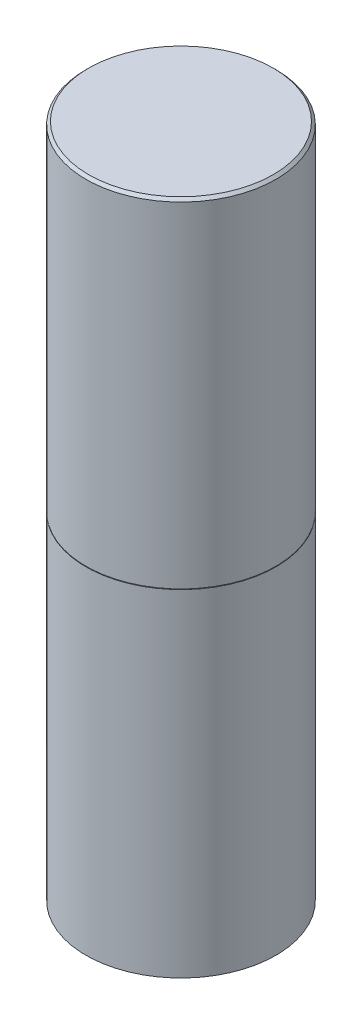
from build123d import *

# Parameters (mm, degrees)
CHAMFER1_SIZE = 0.5


with BuildPart() as part:
    # Sketch1 → Revolve1 (revolve)
    with BuildSketch(Plane(origin=(0, 0, 0), x_dir=(0, 0, -1), z_dir=(1, 0, 0)), mode=Mode.PRIVATE) as revolve1_sk:
        Polygon((0, 0), (0, 124.25), (-17.5, 124.25), (-17.5, 62.05), (-17.41339746, 62), (-17.5, 61.95), (-17.5, 0), align=None)
    revolve(revolve1_sk.sketch.rotate(Axis((0, 0, 0), (0, 1, 0)), 180), axis=Axis((0, 0, 0), (0, 1, 0)))

    # Chamfer1
    chamfer1_edges = [part.edges().sort_by_distance(p)[0] for p in [
        (0, 124.25, 17.5),
    ]]
    chamfer(chamfer1_edges, length=CHAMFER1_SIZE)


solid = part.part
